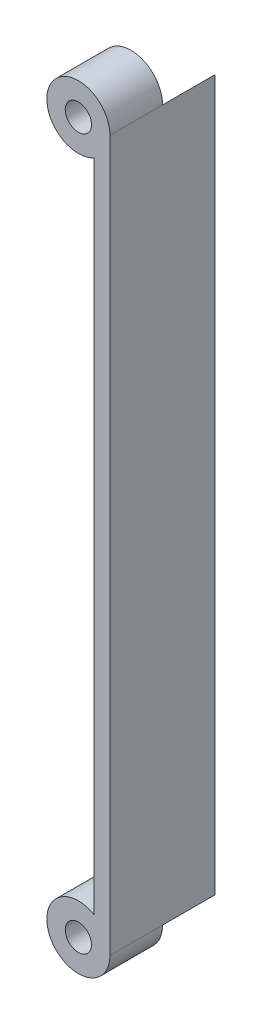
ISO-10303-21;
HEADER;
FILE_DESCRIPTION(('STEP AP214'),'2;1');
FILE_NAME('part.step','',(''),(''),'','','');
FILE_SCHEMA(('AUTOMOTIVE_DESIGN { 1 0 10303 214 1 1 1 1 }'));
ENDSEC;
DATA;
#1=APPLICATION_CONTEXT('core data for automotive mechanical design processes');
#2=APPLICATION_PROTOCOL_DEFINITION('international standard','automotive_design',2000,#1);
#3=PRODUCT_CONTEXT('',#1,'mechanical');
#4=PRODUCT('Part','Part','',(#3));
#5=PRODUCT_RELATED_PRODUCT_CATEGORY('part','',(#4));
#6=PRODUCT_DEFINITION_FORMATION('','',#4);
#7=PRODUCT_DEFINITION_CONTEXT('part definition',#1,'design');
#8=PRODUCT_DEFINITION('design','',#6,#7);
#9=PRODUCT_DEFINITION_SHAPE('','',#8);
#10=(LENGTH_UNIT() NAMED_UNIT(*) SI_UNIT(.MILLI.,.METRE.));
#11=(NAMED_UNIT(*) PLANE_ANGLE_UNIT() SI_UNIT($,.RADIAN.));
#12=(NAMED_UNIT(*) SI_UNIT($,.STERADIAN.) SOLID_ANGLE_UNIT());
#13=UNCERTAINTY_MEASURE_WITH_UNIT(LENGTH_MEASURE(1.E-05),#10,'distance_accuracy_value','');
#14=(GEOMETRIC_REPRESENTATION_CONTEXT(3) GLOBAL_UNCERTAINTY_ASSIGNED_CONTEXT((#13)) GLOBAL_UNIT_ASSIGNED_CONTEXT((#10,
#11,#12)) REPRESENTATION_CONTEXT('',''));
#15=CARTESIAN_POINT('',(0.,0.,0.));
#16=DIRECTION('',(0.,0.,1.));
#17=DIRECTION('',(1.,0.,0.));
#18=AXIS2_PLACEMENT_3D('',#15,#16,#17);
#19=CARTESIAN_POINT('',(0.,135.,20.));
#20=DIRECTION('',(0.,0.,-1.));
#21=DIRECTION('',(-1.,0.,0.));
#22=AXIS2_PLACEMENT_3D('',#19,#20,#21);
#23=CYLINDRICAL_SURFACE('',#22,6.);
#24=CARTESIAN_POINT('',(0.,135.,10.));
#25=DIRECTION('',(0.,0.,-1.));
#26=DIRECTION('',(-1.,0.,0.));
#27=AXIS2_PLACEMENT_3D('',#24,#25,#26);
#28=CIRCLE('',#27,6.);
#29=CARTESIAN_POINT('',(2.99999999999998,129.803847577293,10.));
#30=VERTEX_POINT('',#29);
#31=CARTESIAN_POINT('',(5.99999999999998,135.,10.));
#32=VERTEX_POINT('',#31);
#33=EDGE_CURVE('E135',#30,#32,#28,.T.);
#34=ORIENTED_EDGE('',*,*,#33,.F.);
#35=DIRECTION('',(0.,0.,-1.));
#36=VECTOR('',#35,1.);
#37=CARTESIAN_POINT('',(2.99999999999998,129.803847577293,20.));
#38=LINE('',#37,#36);
#39=CARTESIAN_POINT('',(2.99999999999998,129.803847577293,20.));
#40=VERTEX_POINT('',#39);
#41=EDGE_CURVE('E11',#40,#30,#38,.T.);
#42=ORIENTED_EDGE('',*,*,#41,.F.);
#43=CARTESIAN_POINT('',(0.,135.,20.));
#44=DIRECTION('',(0.,0.,1.));
#45=DIRECTION('',(1.,0.,0.));
#46=AXIS2_PLACEMENT_3D('',#43,#44,#45);
#47=CIRCLE('',#46,6.);
#48=CARTESIAN_POINT('',(5.99999999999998,135.,20.));
#49=VERTEX_POINT('',#48);
#50=EDGE_CURVE('E93',#49,#40,#47,.T.);
#51=ORIENTED_EDGE('',*,*,#50,.F.);
#52=DIRECTION('',(0.,0.,-1.));
#53=VECTOR('',#52,1.);
#54=CARTESIAN_POINT('',(5.99999999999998,135.,20.));
#55=LINE('',#54,#53);
#56=EDGE_CURVE('E119',#49,#32,#55,.T.);
#57=ORIENTED_EDGE('',*,*,#56,.T.);
#58=EDGE_LOOP('',(#34,#42,#51,#57));
#59=FACE_BOUND('',#58,.T.);
#60=ADVANCED_FACE('F33',(#59),#23,.T.);
#61=CARTESIAN_POINT('',(0.,0.,20.));
#62=DIRECTION('',(0.,0.,-1.));
#63=DIRECTION('',(-1.,0.,0.));
#64=AXIS2_PLACEMENT_3D('',#61,#62,#63);
#65=CYLINDRICAL_SURFACE('',#64,6.);
#66=CARTESIAN_POINT('',(0.,0.,10.));
#67=DIRECTION('',(0.,0.,-1.));
#68=DIRECTION('',(-1.,0.,0.));
#69=AXIS2_PLACEMENT_3D('',#66,#67,#68);
#70=CIRCLE('',#69,6.);
#71=CARTESIAN_POINT('',(6.,0.,10.));
#72=VERTEX_POINT('',#71);
#73=CARTESIAN_POINT('',(3.,5.19615242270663,10.));
#74=VERTEX_POINT('',#73);
#75=EDGE_CURVE('E129',#72,#74,#70,.T.);
#76=ORIENTED_EDGE('',*,*,#75,.F.);
#77=DIRECTION('',(0.,0.,-1.));
#78=VECTOR('',#77,1.);
#79=CARTESIAN_POINT('',(6.,0.,20.));
#80=LINE('',#79,#78);
#81=CARTESIAN_POINT('',(6.,0.,20.));
#82=VERTEX_POINT('',#81);
#83=EDGE_CURVE('E104',#82,#72,#80,.T.);
#84=ORIENTED_EDGE('',*,*,#83,.F.);
#85=CARTESIAN_POINT('',(0.,0.,20.));
#86=DIRECTION('',(0.,0.,1.));
#87=DIRECTION('',(1.,0.,0.));
#88=AXIS2_PLACEMENT_3D('',#85,#86,#87);
#89=CIRCLE('',#88,6.);
#90=CARTESIAN_POINT('',(3.,5.19615242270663,20.));
#91=VERTEX_POINT('',#90);
#92=EDGE_CURVE('E90',#91,#82,#89,.T.);
#93=ORIENTED_EDGE('',*,*,#92,.F.);
#94=DIRECTION('',(0.,0.,-1.));
#95=VECTOR('',#94,1.);
#96=CARTESIAN_POINT('',(3.,5.19615242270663,20.));
#97=LINE('',#96,#95);
#98=EDGE_CURVE('E41',#91,#74,#97,.T.);
#99=ORIENTED_EDGE('',*,*,#98,.T.);
#100=EDGE_LOOP('',(#76,#84,#93,#99));
#101=FACE_BOUND('',#100,.T.);
#102=ADVANCED_FACE('F106',(#101),#65,.T.);
#103=CARTESIAN_POINT('',(0.,0.,20.));
#104=DIRECTION('',(0.,0.,-1.));
#105=DIRECTION('',(-1.,0.,0.));
#106=AXIS2_PLACEMENT_3D('',#103,#104,#105);
#107=CYLINDRICAL_SURFACE('',#106,2.5);
#108=CARTESIAN_POINT('',(0.,0.,20.));
#109=DIRECTION('',(0.,0.,1.));
#110=DIRECTION('',(1.,0.,0.));
#111=AXIS2_PLACEMENT_3D('',#108,#109,#110);
#112=CIRCLE('',#111,2.5);
#113=CARTESIAN_POINT('',(2.5,0.,20.));
#114=VERTEX_POINT('',#113);
#115=EDGE_CURVE('E116',#114,#114,#112,.T.);
#116=ORIENTED_EDGE('',*,*,#115,.T.);
#117=EDGE_LOOP('',(#116));
#118=FACE_BOUND('',#117,.T.);
#119=CARTESIAN_POINT('',(0.,0.,10.));
#120=DIRECTION('',(0.,0.,-1.));
#121=DIRECTION('',(-1.,0.,0.));
#122=AXIS2_PLACEMENT_3D('',#119,#120,#121);
#123=CIRCLE('',#122,2.5);
#124=CARTESIAN_POINT('',(-2.5,0.,10.));
#125=VERTEX_POINT('',#124);
#126=EDGE_CURVE('E36',#125,#125,#123,.T.);
#127=ORIENTED_EDGE('',*,*,#126,.T.);
#128=EDGE_LOOP('',(#127));
#129=FACE_BOUND('',#128,.T.);
#130=ADVANCED_FACE('F148',(#118,#129),#107,.F.);
#131=CARTESIAN_POINT('',(0.,135.,20.));
#132=DIRECTION('',(0.,0.,-1.));
#133=DIRECTION('',(-1.,0.,0.));
#134=AXIS2_PLACEMENT_3D('',#131,#132,#133);
#135=CYLINDRICAL_SURFACE('',#134,2.5);
#136=CARTESIAN_POINT('',(0.,135.,20.));
#137=DIRECTION('',(0.,0.,1.));
#138=DIRECTION('',(1.,0.,0.));
#139=AXIS2_PLACEMENT_3D('',#136,#137,#138);
#140=CIRCLE('',#139,2.5);
#141=CARTESIAN_POINT('',(2.49999999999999,135.,20.));
#142=VERTEX_POINT('',#141);
#143=EDGE_CURVE('E142',#142,#142,#140,.T.);
#144=ORIENTED_EDGE('',*,*,#143,.T.);
#145=EDGE_LOOP('',(#144));
#146=FACE_BOUND('',#145,.T.);
#147=CARTESIAN_POINT('',(0.,135.,10.));
#148=DIRECTION('',(0.,0.,-1.));
#149=DIRECTION('',(-1.,0.,0.));
#150=AXIS2_PLACEMENT_3D('',#147,#148,#149);
#151=CIRCLE('',#150,2.5);
#152=CARTESIAN_POINT('',(-2.50000000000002,135.,10.));
#153=VERTEX_POINT('',#152);
#154=EDGE_CURVE('E122',#153,#153,#151,.T.);
#155=ORIENTED_EDGE('',*,*,#154,.T.);
#156=EDGE_LOOP('',(#155));
#157=FACE_BOUND('',#156,.T.);
#158=ADVANCED_FACE('F153',(#146,#157),#135,.F.);
#159=CARTESIAN_POINT('',(0.,135.,20.));
#160=DIRECTION('',(0.,0.,1.));
#161=DIRECTION('',(1.,0.,0.));
#162=AXIS2_PLACEMENT_3D('',#159,#160,#161);
#163=PLANE('',#162);
#164=ORIENTED_EDGE('',*,*,#115,.F.);
#165=EDGE_LOOP('',(#164));
#166=FACE_BOUND('',#165,.T.);
#167=ORIENTED_EDGE('',*,*,#50,.T.);
#168=DIRECTION('',(0.,-1.,0.));
#169=VECTOR('',#168,1.);
#170=CARTESIAN_POINT('',(2.99999999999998,129.803847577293,20.));
#171=LINE('',#170,#169);
#172=EDGE_CURVE('E85',#40,#91,#171,.T.);
#173=ORIENTED_EDGE('',*,*,#172,.T.);
#174=ORIENTED_EDGE('',*,*,#92,.T.);
#175=DIRECTION('',(0.,1.,0.));
#176=VECTOR('',#175,1.);
#177=CARTESIAN_POINT('',(5.99999999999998,135.,20.));
#178=LINE('',#177,#176);
#179=EDGE_CURVE('E58',#82,#49,#178,.T.);
#180=ORIENTED_EDGE('',*,*,#179,.T.);
#181=EDGE_LOOP('',(#167,#173,#174,#180));
#182=FACE_BOUND('',#181,.T.);
#183=ORIENTED_EDGE('',*,*,#143,.F.);
#184=EDGE_LOOP('',(#183));
#185=FACE_BOUND('',#184,.T.);
#186=ADVANCED_FACE('F87',(#166,#182,#185),#163,.T.);
#187=CARTESIAN_POINT('',(0.,135.,0.));
#188=DIRECTION('',(0.,0.,1.));
#189=DIRECTION('',(1.,0.,0.));
#190=AXIS2_PLACEMENT_3D('',#187,#188,#189);
#191=PLANE('',#190);
#192=DIRECTION('',(0.,1.,0.));
#193=VECTOR('',#192,1.);
#194=CARTESIAN_POINT('',(5.99999999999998,135.,0.));
#195=LINE('',#194,#193);
#196=CARTESIAN_POINT('',(6.,0.,0.));
#197=VERTEX_POINT('',#196);
#198=CARTESIAN_POINT('',(5.99999999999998,135.,0.));
#199=VERTEX_POINT('',#198);
#200=EDGE_CURVE('E115',#197,#199,#195,.T.);
#201=ORIENTED_EDGE('',*,*,#200,.F.);
#202=CARTESIAN_POINT('',(0.,0.,0.));
#203=DIRECTION('',(0.,0.,-1.));
#204=DIRECTION('',(-1.,0.,0.));
#205=AXIS2_PLACEMENT_3D('',#202,#203,#204);
#206=CIRCLE('',#205,6.);
#207=CARTESIAN_POINT('',(3.,5.19615242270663,0.));
#208=VERTEX_POINT('',#207);
#209=EDGE_CURVE('E71',#208,#197,#206,.T.);
#210=ORIENTED_EDGE('',*,*,#209,.F.);
#211=DIRECTION('',(0.,-1.,0.));
#212=VECTOR('',#211,1.);
#213=CARTESIAN_POINT('',(2.99999999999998,129.803847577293,0.));
#214=LINE('',#213,#212);
#215=CARTESIAN_POINT('',(2.99999999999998,129.803847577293,0.));
#216=VERTEX_POINT('',#215);
#217=EDGE_CURVE('E113',#216,#208,#214,.T.);
#218=ORIENTED_EDGE('',*,*,#217,.F.);
#219=CARTESIAN_POINT('',(0.,135.,0.));
#220=DIRECTION('',(0.,0.,-1.));
#221=DIRECTION('',(-1.,0.,0.));
#222=AXIS2_PLACEMENT_3D('',#219,#220,#221);
#223=CIRCLE('',#222,6.);
#224=EDGE_CURVE('E136',#199,#216,#223,.T.);
#225=ORIENTED_EDGE('',*,*,#224,.F.);
#226=EDGE_LOOP('',(#201,#210,#218,#225));
#227=FACE_BOUND('',#226,.T.);
#228=ADVANCED_FACE('F152',(#227),#191,.F.);
#229=CARTESIAN_POINT('',(2.99999999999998,129.803847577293,20.));
#230=DIRECTION('',(1.,0.,0.));
#231=DIRECTION('',(0.,1.,0.));
#232=AXIS2_PLACEMENT_3D('',#229,#230,#231);
#233=PLANE('',#232);
#234=ORIENTED_EDGE('',*,*,#217,.T.);
#235=DIRECTION('',(0.,0.,-1.));
#236=VECTOR('',#235,1.);
#237=CARTESIAN_POINT('',(3.,5.19615242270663,10.));
#238=LINE('',#237,#236);
#239=EDGE_CURVE('E101',#208,#74,#238,.F.);
#240=ORIENTED_EDGE('',*,*,#239,.T.);
#241=ORIENTED_EDGE('',*,*,#98,.F.);
#242=ORIENTED_EDGE('',*,*,#172,.F.);
#243=ORIENTED_EDGE('',*,*,#41,.T.);
#244=DIRECTION('',(0.,0.,-1.));
#245=VECTOR('',#244,1.);
#246=CARTESIAN_POINT('',(2.99999999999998,129.803847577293,10.));
#247=LINE('',#246,#245);
#248=EDGE_CURVE('E128',#30,#216,#247,.T.);
#249=ORIENTED_EDGE('',*,*,#248,.T.);
#250=EDGE_LOOP('',(#234,#240,#241,#242,#243,#249));
#251=FACE_BOUND('',#250,.T.);
#252=ADVANCED_FACE('F100',(#251),#233,.F.);
#253=CARTESIAN_POINT('',(5.99999999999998,135.,20.));
#254=DIRECTION('',(-1.,0.,0.));
#255=DIRECTION('',(0.,-1.,0.));
#256=AXIS2_PLACEMENT_3D('',#253,#254,#255);
#257=PLANE('',#256);
#258=ORIENTED_EDGE('',*,*,#200,.T.);
#259=EDGE_CURVE('E109',#32,#199,#55,.T.);
#260=ORIENTED_EDGE('',*,*,#259,.F.);
#261=ORIENTED_EDGE('',*,*,#56,.F.);
#262=ORIENTED_EDGE('',*,*,#179,.F.);
#263=ORIENTED_EDGE('',*,*,#83,.T.);
#264=EDGE_CURVE('E78',#72,#197,#80,.T.);
#265=ORIENTED_EDGE('',*,*,#264,.T.);
#266=EDGE_LOOP('',(#258,#260,#261,#262,#263,#265));
#267=FACE_BOUND('',#266,.T.);
#268=ADVANCED_FACE('F184',(#267),#257,.F.);
#269=CARTESIAN_POINT('',(0.,135.,10.));
#270=DIRECTION('',(0.,0.,-1.));
#271=DIRECTION('',(-1.,0.,0.));
#272=AXIS2_PLACEMENT_3D('',#269,#270,#271);
#273=CYLINDRICAL_SURFACE('',#272,6.);
#274=EDGE_CURVE('E49',#32,#30,#28,.T.);
#275=ORIENTED_EDGE('',*,*,#274,.F.);
#276=ORIENTED_EDGE('',*,*,#259,.T.);
#277=ORIENTED_EDGE('',*,*,#224,.T.);
#278=ORIENTED_EDGE('',*,*,#248,.F.);
#279=EDGE_LOOP('',(#275,#276,#277,#278));
#280=FACE_BOUND('',#279,.T.);
#281=ADVANCED_FACE('F182',(#280),#273,.F.);
#282=CARTESIAN_POINT('',(0.,135.,10.));
#283=DIRECTION('',(0.,0.,-1.));
#284=DIRECTION('',(-1.,0.,0.));
#285=AXIS2_PLACEMENT_3D('',#282,#283,#284);
#286=PLANE('',#285);
#287=ORIENTED_EDGE('',*,*,#154,.F.);
#288=EDGE_LOOP('',(#287));
#289=FACE_BOUND('',#288,.T.);
#290=ORIENTED_EDGE('',*,*,#274,.T.);
#291=ORIENTED_EDGE('',*,*,#33,.T.);
#292=EDGE_LOOP('',(#290,#291));
#293=FACE_BOUND('',#292,.T.);
#294=ADVANCED_FACE('F191',(#289,#293),#286,.T.);
#295=CARTESIAN_POINT('',(0.,0.,10.));
#296=DIRECTION('',(0.,0.,-1.));
#297=DIRECTION('',(-1.,0.,0.));
#298=AXIS2_PLACEMENT_3D('',#295,#296,#297);
#299=CYLINDRICAL_SURFACE('',#298,6.);
#300=ORIENTED_EDGE('',*,*,#209,.T.);
#301=ORIENTED_EDGE('',*,*,#264,.F.);
#302=EDGE_CURVE('E124',#74,#72,#70,.T.);
#303=ORIENTED_EDGE('',*,*,#302,.F.);
#304=ORIENTED_EDGE('',*,*,#239,.F.);
#305=EDGE_LOOP('',(#300,#301,#303,#304));
#306=FACE_BOUND('',#305,.T.);
#307=ADVANCED_FACE('F242',(#306),#299,.F.);
#308=CARTESIAN_POINT('',(0.,0.,10.));
#309=DIRECTION('',(0.,0.,-1.));
#310=DIRECTION('',(-1.,0.,0.));
#311=AXIS2_PLACEMENT_3D('',#308,#309,#310);
#312=PLANE('',#311);
#313=ORIENTED_EDGE('',*,*,#126,.F.);
#314=EDGE_LOOP('',(#313));
#315=FACE_BOUND('',#314,.T.);
#316=ORIENTED_EDGE('',*,*,#302,.T.);
#317=ORIENTED_EDGE('',*,*,#75,.T.);
#318=EDGE_LOOP('',(#316,#317));
#319=FACE_BOUND('',#318,.T.);
#320=ADVANCED_FACE('F251',(#315,#319),#312,.T.);
#321=CLOSED_SHELL('',(#60,#102,#130,#158,#186,#228,#252,#268,#281,#294,#307,#320));
#322=MANIFOLD_SOLID_BREP('B2',#321);
#323=ADVANCED_BREP_SHAPE_REPRESENTATION('',(#18,#322),#14);
#324=SHAPE_DEFINITION_REPRESENTATION(#9,#323);
ENDSEC;
END-ISO-10303-21;
